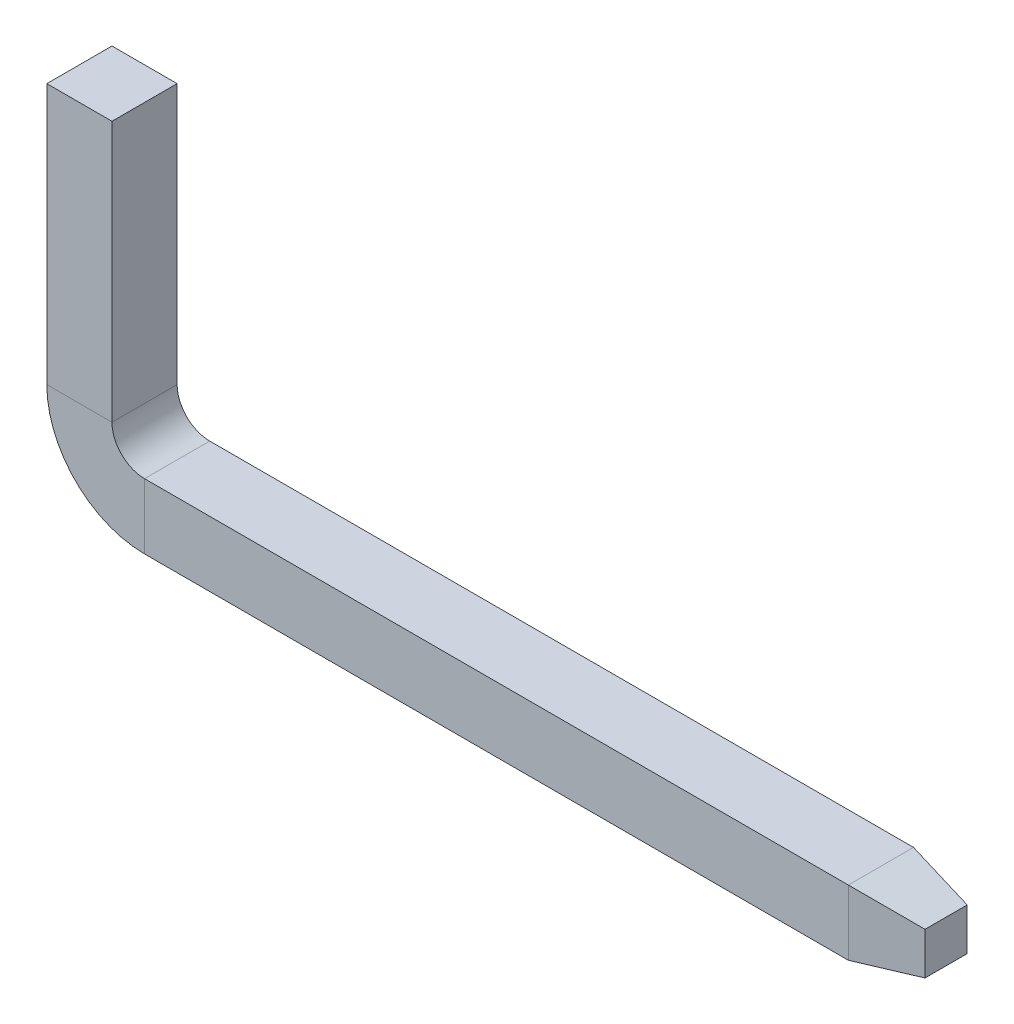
from build123d import *

# Parameters (mm, degrees)
SKETCH1_W           = 0.5
SKETCH1_H           = 0.5
SKETCH4_W           = 0.5
SKETCH4_H           = 0.5
BOSS_EXTRUDE1_DEPTH = 0.5
BOSS_EXTRUDE1_TAPER = 10


with BuildPart() as part:
    # Sweep1: sweep along a path in Sketch2
    with BuildLine(Plane.XY) as sweep1_path:
        Line((0, 0), (0, -2))
        ThreePointArc((0, -2), (0.146446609, -2.353553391), (0.5, -2.5))
        Line((0.5, -2.5), (5.9, -2.5))
    # Sketch1 → Sweep1 (sweep)
    with BuildSketch(Plane(origin=(0, 0, 0), x_dir=(1, 0, 0), z_dir=(0, 1, 0))):
        Rectangle(SKETCH1_W, SKETCH1_H)
    sweep(path=sweep1_path.line)

    # Sketch4 → Boss-Extrude1 (add)
    with BuildSketch(Plane(origin=(5.9, 0, 0), x_dir=(0, 0, -1), z_dir=(1, 0, 0))):
        with Locations((0, -2.5)):
            Rectangle(SKETCH4_W, SKETCH4_H)
    extrude(amount=BOSS_EXTRUDE1_DEPTH, taper=BOSS_EXTRUDE1_TAPER)


solid = part.part
